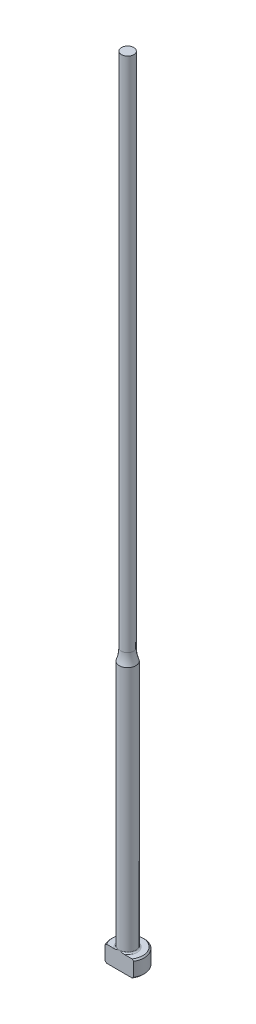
from build123d import *

# Parameters (mm, degrees)
CHAMFER1_SIZE = 0.254
FILLET1_R     = 0.254
KEY_DEPTH     = 153.466131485


with BuildPart() as part:
    # Sketch1 → Revolve1 (revolve)
    with BuildSketch(Plane.XY, mode=Mode.PRIVATE) as revolve1_sk:
        with BuildLine():
            Line((0, 0), (-3.175, 0))
            Line((-3.175, 0), (-3.175, 3.175))
            Line((-3.175, 3.175), (-1.5875, 3.175))
            Line((-1.5875, 3.175), (-1.5875, 50.8))
            ThreePointArc((-1.5875, 50.8), (-1.290157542, 51.887986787), (-1.18999, 53.011416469))
            Line((-1.18999, 53.011416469), (-1.18999, 152.4))
            Line((-1.18999, 152.4), (0, 152.4))
            Line((0, 152.4), (0, 0))
        make_face()
    revolve(revolve1_sk.sketch.rotate(Axis((0, 259.958771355, 0), (0, -1, 0)), 270), axis=Axis((0, 259.958771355, 0), (0, -1, 0)))

    # Chamfer1
    chamfer1_edges = [part.edges().sort_by_distance(p)[0] for p in [
        (0, 0, -3.175),
        (0, 3.175, -3.175),
    ]]
    chamfer(chamfer1_edges, length=CHAMFER1_SIZE)

    # Fillet1
    fillet1_edges = [part.edges().sort_by_distance(p)[0] for p in [
        (0, 3.175, -1.5875),
    ]]
    fillet(fillet1_edges, radius=FILLET1_R)

    # Sketch2 → KEY (cut, through all)
    with BuildSketch(Plane.XZ):
        with BuildLine():
            Line((-2.749630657, 1.5875), (2.749630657, 1.5875))
            ThreePointArc((2.749630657, 1.5875), (0, 3.175), (-2.749630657, 1.5875))
        make_face()
    extrude(amount=-KEY_DEPTH, mode=Mode.SUBTRACT)


solid = part.part
